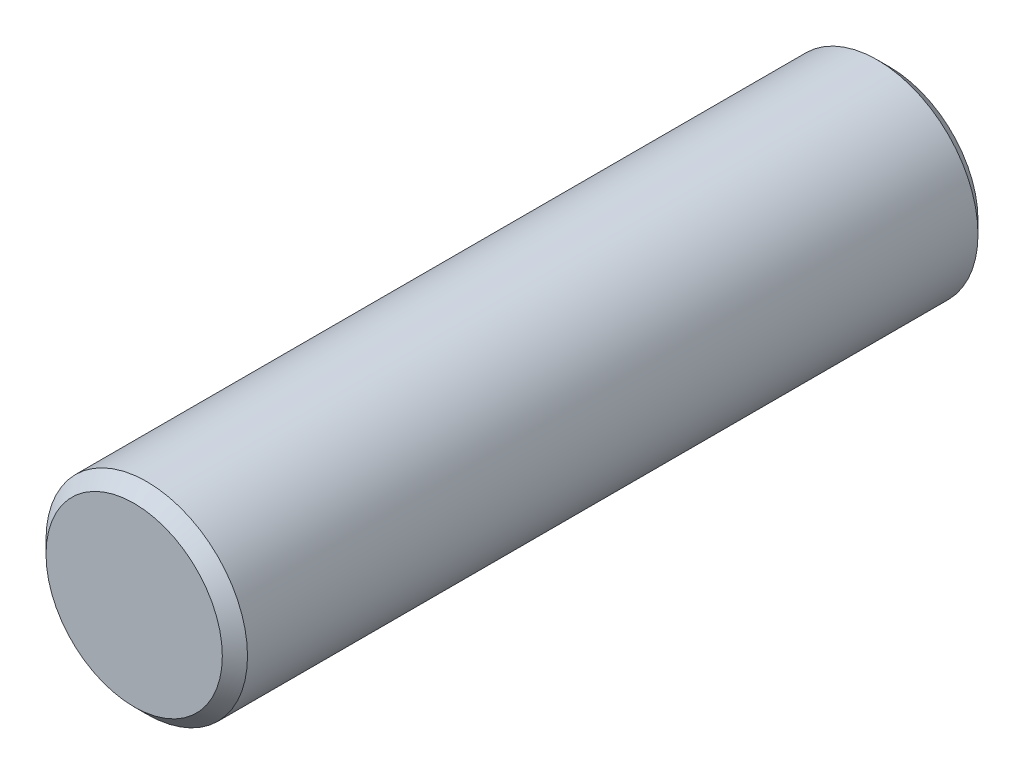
from build123d import *

# Parameters (mm, degrees)
ESQUISSE1_R        = 8
BOSS_EXTRU_1_DEPTH = 60
CHANFREIN1_SIZE    = 1


with BuildPart() as part:
    # Esquisse1 → Boss.-Extru.1 (new body)
    with BuildSketch(Plane.XY):
        Circle(ESQUISSE1_R)
    extrude(amount=BOSS_EXTRU_1_DEPTH)

    # Chanfrein1
    chanfrein1_edges = [part.edges().sort_by_distance(p)[0] for p in [
        (-8, 0, 0),
        (-8, 0, 60),
    ]]
    chamfer(chanfrein1_edges, length=CHANFREIN1_SIZE)


solid = part.part
